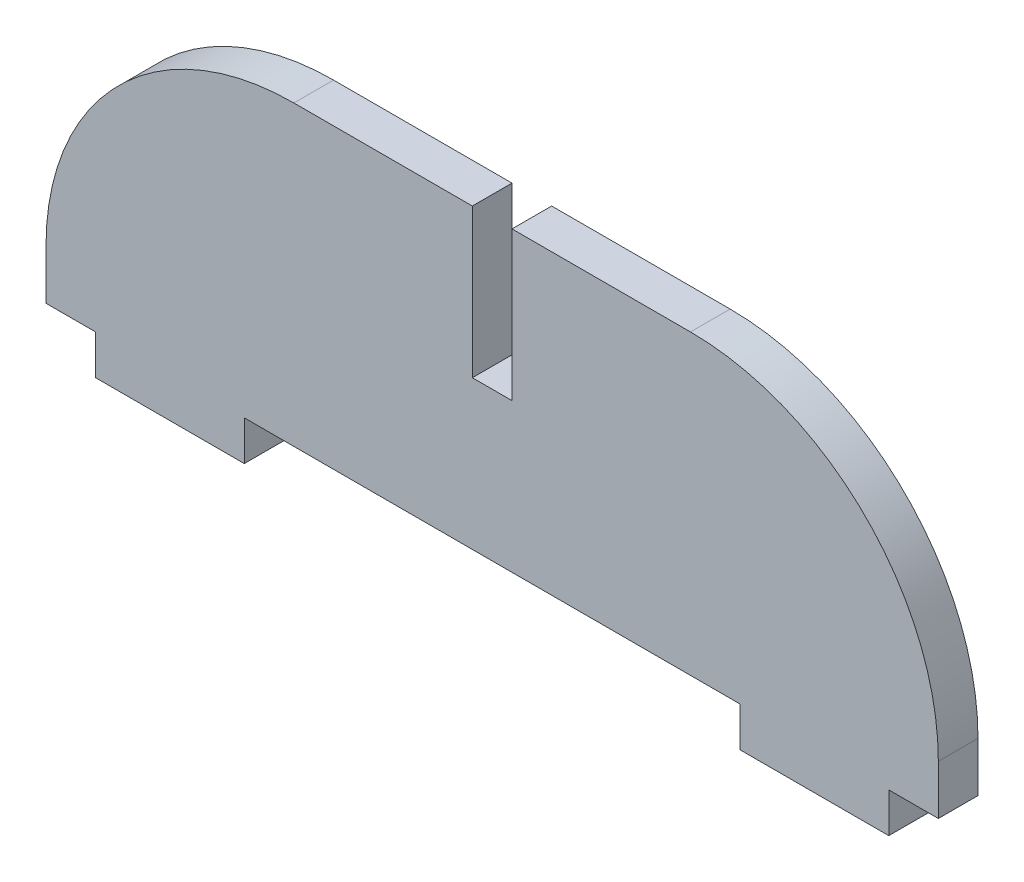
ISO-10303-21;
HEADER;
FILE_DESCRIPTION(('STEP AP214'),'2;1');
FILE_NAME('part.step','',(''),(''),'','','');
FILE_SCHEMA(('AUTOMOTIVE_DESIGN { 1 0 10303 214 1 1 1 1 }'));
ENDSEC;
DATA;
#1=APPLICATION_CONTEXT('core data for automotive mechanical design processes');
#2=APPLICATION_PROTOCOL_DEFINITION('international standard','automotive_design',2000,#1);
#3=PRODUCT_CONTEXT('',#1,'mechanical');
#4=PRODUCT('Part','Part','',(#3));
#5=PRODUCT_RELATED_PRODUCT_CATEGORY('part','',(#4));
#6=PRODUCT_DEFINITION_FORMATION('','',#4);
#7=PRODUCT_DEFINITION_CONTEXT('part definition',#1,'design');
#8=PRODUCT_DEFINITION('design','',#6,#7);
#9=PRODUCT_DEFINITION_SHAPE('','',#8);
#10=(LENGTH_UNIT() NAMED_UNIT(*) SI_UNIT(.MILLI.,.METRE.));
#11=(NAMED_UNIT(*) PLANE_ANGLE_UNIT() SI_UNIT($,.RADIAN.));
#12=(NAMED_UNIT(*) SI_UNIT($,.STERADIAN.) SOLID_ANGLE_UNIT());
#13=UNCERTAINTY_MEASURE_WITH_UNIT(LENGTH_MEASURE(1.E-05),#10,'distance_accuracy_value','');
#14=(GEOMETRIC_REPRESENTATION_CONTEXT(3) GLOBAL_UNCERTAINTY_ASSIGNED_CONTEXT((#13)) GLOBAL_UNIT_ASSIGNED_CONTEXT((#10,
#11,#12)) REPRESENTATION_CONTEXT('',''));
#15=CARTESIAN_POINT('',(0.,0.,0.));
#16=DIRECTION('',(0.,0.,1.));
#17=DIRECTION('',(1.,0.,0.));
#18=AXIS2_PLACEMENT_3D('',#15,#16,#17);
#19=CARTESIAN_POINT('',(-45.,0.,2.));
#20=DIRECTION('',(1.,0.,0.));
#21=DIRECTION('',(0.,0.,-1.));
#22=AXIS2_PLACEMENT_3D('',#19,#20,#21);
#23=PLANE('',#22);
#24=DIRECTION('',(0.,-1.,0.));
#25=VECTOR('',#24,1.);
#26=CARTESIAN_POINT('',(-45.,0.,-2.));
#27=LINE('',#26,#25);
#28=CARTESIAN_POINT('',(-45.,5.,-2.));
#29=VERTEX_POINT('',#28);
#30=CARTESIAN_POINT('',(-45.,0.,-2.));
#31=VERTEX_POINT('',#30);
#32=EDGE_CURVE('E188',#29,#31,#27,.T.);
#33=ORIENTED_EDGE('',*,*,#32,.T.);
#34=DIRECTION('',(0.,0.,-1.));
#35=VECTOR('',#34,1.);
#36=CARTESIAN_POINT('',(-45.,0.,2.));
#37=LINE('',#36,#35);
#38=CARTESIAN_POINT('',(-45.,0.,2.));
#39=VERTEX_POINT('',#38);
#40=EDGE_CURVE('E11',#39,#31,#37,.T.);
#41=ORIENTED_EDGE('',*,*,#40,.F.);
#42=DIRECTION('',(0.,-1.,0.));
#43=VECTOR('',#42,1.);
#44=CARTESIAN_POINT('',(-45.,0.,2.));
#45=LINE('',#44,#43);
#46=CARTESIAN_POINT('',(-45.,5.,2.));
#47=VERTEX_POINT('',#46);
#48=EDGE_CURVE('E222',#47,#39,#45,.T.);
#49=ORIENTED_EDGE('',*,*,#48,.F.);
#50=DIRECTION('',(0.,0.,-1.));
#51=VECTOR('',#50,1.);
#52=CARTESIAN_POINT('',(-45.,5.,2.));
#53=LINE('',#52,#51);
#54=EDGE_CURVE('E184',#47,#29,#53,.T.);
#55=ORIENTED_EDGE('',*,*,#54,.T.);
#56=EDGE_LOOP('',(#33,#41,#49,#55));
#57=FACE_BOUND('',#56,.T.);
#58=ADVANCED_FACE('F32',(#57),#23,.F.);
#59=CARTESIAN_POINT('',(-45.,0.,2.));
#60=DIRECTION('',(0.,1.,0.));
#61=DIRECTION('',(0.,0.,1.));
#62=AXIS2_PLACEMENT_3D('',#59,#60,#61);
#63=PLANE('',#62);
#64=DIRECTION('',(1.,0.,0.));
#65=VECTOR('',#64,1.);
#66=CARTESIAN_POINT('',(-45.,0.,-2.));
#67=LINE('',#66,#65);
#68=CARTESIAN_POINT('',(-40.,0.,-2.));
#69=VERTEX_POINT('',#68);
#70=EDGE_CURVE('E191',#31,#69,#67,.T.);
#71=ORIENTED_EDGE('',*,*,#70,.T.);
#72=DIRECTION('',(0.,0.,-1.));
#73=VECTOR('',#72,1.);
#74=CARTESIAN_POINT('',(-40.,0.,2.));
#75=LINE('',#74,#73);
#76=CARTESIAN_POINT('',(-40.,0.,2.));
#77=VERTEX_POINT('',#76);
#78=EDGE_CURVE('E40',#77,#69,#75,.T.);
#79=ORIENTED_EDGE('',*,*,#78,.F.);
#80=DIRECTION('',(1.,0.,0.));
#81=VECTOR('',#80,1.);
#82=CARTESIAN_POINT('',(-45.,0.,2.));
#83=LINE('',#82,#81);
#84=EDGE_CURVE('E121',#39,#77,#83,.T.);
#85=ORIENTED_EDGE('',*,*,#84,.F.);
#86=ORIENTED_EDGE('',*,*,#40,.T.);
#87=EDGE_LOOP('',(#71,#79,#85,#86));
#88=FACE_BOUND('',#87,.T.);
#89=ADVANCED_FACE('F330',(#88),#63,.F.);
#90=CARTESIAN_POINT('',(-40.,0.,2.));
#91=DIRECTION('',(1.,0.,0.));
#92=DIRECTION('',(0.,0.,-1.));
#93=AXIS2_PLACEMENT_3D('',#90,#91,#92);
#94=PLANE('',#93);
#95=DIRECTION('',(0.,-1.,0.));
#96=VECTOR('',#95,1.);
#97=CARTESIAN_POINT('',(-40.,0.,-2.));
#98=LINE('',#97,#96);
#99=CARTESIAN_POINT('',(-40.,-4.,-2.));
#100=VERTEX_POINT('',#99);
#101=EDGE_CURVE('E193',#69,#100,#98,.T.);
#102=ORIENTED_EDGE('',*,*,#101,.T.);
#103=DIRECTION('',(0.,0.,-1.));
#104=VECTOR('',#103,1.);
#105=CARTESIAN_POINT('',(-40.,-4.,2.));
#106=LINE('',#105,#104);
#107=CARTESIAN_POINT('',(-40.,-4.,2.));
#108=VERTEX_POINT('',#107);
#109=EDGE_CURVE('E259',#108,#100,#106,.T.);
#110=ORIENTED_EDGE('',*,*,#109,.F.);
#111=DIRECTION('',(0.,-1.,0.));
#112=VECTOR('',#111,1.);
#113=CARTESIAN_POINT('',(-40.,0.,2.));
#114=LINE('',#113,#112);
#115=EDGE_CURVE('E267',#77,#108,#114,.T.);
#116=ORIENTED_EDGE('',*,*,#115,.F.);
#117=ORIENTED_EDGE('',*,*,#78,.T.);
#118=EDGE_LOOP('',(#102,#110,#116,#117));
#119=FACE_BOUND('',#118,.T.);
#120=ADVANCED_FACE('F265',(#119),#94,.F.);
#121=CARTESIAN_POINT('',(-40.,-4.,2.));
#122=DIRECTION('',(0.,1.,0.));
#123=DIRECTION('',(0.,0.,1.));
#124=AXIS2_PLACEMENT_3D('',#121,#122,#123);
#125=PLANE('',#124);
#126=DIRECTION('',(1.,0.,0.));
#127=VECTOR('',#126,1.);
#128=CARTESIAN_POINT('',(-40.,-4.,-2.));
#129=LINE('',#128,#127);
#130=CARTESIAN_POINT('',(-25.,-4.,-2.));
#131=VERTEX_POINT('',#130);
#132=EDGE_CURVE('E195',#100,#131,#129,.T.);
#133=ORIENTED_EDGE('',*,*,#132,.T.);
#134=DIRECTION('',(0.,0.,-1.));
#135=VECTOR('',#134,1.);
#136=CARTESIAN_POINT('',(-25.,-4.,2.));
#137=LINE('',#136,#135);
#138=CARTESIAN_POINT('',(-25.,-4.,2.));
#139=VERTEX_POINT('',#138);
#140=EDGE_CURVE('E256',#139,#131,#137,.T.);
#141=ORIENTED_EDGE('',*,*,#140,.F.);
#142=DIRECTION('',(1.,0.,0.));
#143=VECTOR('',#142,1.);
#144=CARTESIAN_POINT('',(-40.,-4.,2.));
#145=LINE('',#144,#143);
#146=EDGE_CURVE('E285',#108,#139,#145,.T.);
#147=ORIENTED_EDGE('',*,*,#146,.F.);
#148=ORIENTED_EDGE('',*,*,#109,.T.);
#149=EDGE_LOOP('',(#133,#141,#147,#148));
#150=FACE_BOUND('',#149,.T.);
#151=ADVANCED_FACE('F276',(#150),#125,.F.);
#152=CARTESIAN_POINT('',(-25.,0.,2.));
#153=DIRECTION('',(-1.,0.,0.));
#154=DIRECTION('',(0.,0.,1.));
#155=AXIS2_PLACEMENT_3D('',#152,#153,#154);
#156=PLANE('',#155);
#157=DIRECTION('',(0.,1.,0.));
#158=VECTOR('',#157,1.);
#159=CARTESIAN_POINT('',(-25.,0.,-2.));
#160=LINE('',#159,#158);
#161=CARTESIAN_POINT('',(-25.,0.,-2.));
#162=VERTEX_POINT('',#161);
#163=EDGE_CURVE('E197',#131,#162,#160,.T.);
#164=ORIENTED_EDGE('',*,*,#163,.T.);
#165=DIRECTION('',(0.,0.,-1.));
#166=VECTOR('',#165,1.);
#167=CARTESIAN_POINT('',(-25.,0.,2.));
#168=LINE('',#167,#166);
#169=CARTESIAN_POINT('',(-25.,0.,2.));
#170=VERTEX_POINT('',#169);
#171=EDGE_CURVE('E253',#170,#162,#168,.T.);
#172=ORIENTED_EDGE('',*,*,#171,.F.);
#173=DIRECTION('',(0.,1.,0.));
#174=VECTOR('',#173,1.);
#175=CARTESIAN_POINT('',(-25.,0.,2.));
#176=LINE('',#175,#174);
#177=EDGE_CURVE('E282',#139,#170,#176,.T.);
#178=ORIENTED_EDGE('',*,*,#177,.F.);
#179=ORIENTED_EDGE('',*,*,#140,.T.);
#180=EDGE_LOOP('',(#164,#172,#178,#179));
#181=FACE_BOUND('',#180,.T.);
#182=ADVANCED_FACE('F280',(#181),#156,.F.);
#183=CARTESIAN_POINT('',(-25.,0.,2.));
#184=DIRECTION('',(0.,1.,0.));
#185=DIRECTION('',(0.,0.,1.));
#186=AXIS2_PLACEMENT_3D('',#183,#184,#185);
#187=PLANE('',#186);
#188=DIRECTION('',(1.,0.,0.));
#189=VECTOR('',#188,1.);
#190=CARTESIAN_POINT('',(-25.,0.,-2.));
#191=LINE('',#190,#189);
#192=CARTESIAN_POINT('',(25.,0.,-2.));
#193=VERTEX_POINT('',#192);
#194=EDGE_CURVE('E199',#162,#193,#191,.T.);
#195=ORIENTED_EDGE('',*,*,#194,.T.);
#196=DIRECTION('',(0.,0.,-1.));
#197=VECTOR('',#196,1.);
#198=CARTESIAN_POINT('',(25.,0.,2.));
#199=LINE('',#198,#197);
#200=CARTESIAN_POINT('',(25.,0.,2.));
#201=VERTEX_POINT('',#200);
#202=EDGE_CURVE('E250',#201,#193,#199,.T.);
#203=ORIENTED_EDGE('',*,*,#202,.F.);
#204=DIRECTION('',(1.,0.,0.));
#205=VECTOR('',#204,1.);
#206=CARTESIAN_POINT('',(-25.,0.,2.));
#207=LINE('',#206,#205);
#208=EDGE_CURVE('E284',#170,#201,#207,.T.);
#209=ORIENTED_EDGE('',*,*,#208,.F.);
#210=ORIENTED_EDGE('',*,*,#171,.T.);
#211=EDGE_LOOP('',(#195,#203,#209,#210));
#212=FACE_BOUND('',#211,.T.);
#213=ADVANCED_FACE('F343',(#212),#187,.F.);
#214=CARTESIAN_POINT('',(25.,0.,2.));
#215=DIRECTION('',(1.,0.,0.));
#216=DIRECTION('',(0.,0.,-1.));
#217=AXIS2_PLACEMENT_3D('',#214,#215,#216);
#218=PLANE('',#217);
#219=DIRECTION('',(0.,-1.,0.));
#220=VECTOR('',#219,1.);
#221=CARTESIAN_POINT('',(25.,0.,-2.));
#222=LINE('',#221,#220);
#223=CARTESIAN_POINT('',(25.,-4.,-2.));
#224=VERTEX_POINT('',#223);
#225=EDGE_CURVE('E201',#193,#224,#222,.T.);
#226=ORIENTED_EDGE('',*,*,#225,.T.);
#227=DIRECTION('',(0.,0.,-1.));
#228=VECTOR('',#227,1.);
#229=CARTESIAN_POINT('',(25.,-4.,2.));
#230=LINE('',#229,#228);
#231=CARTESIAN_POINT('',(25.,-4.,2.));
#232=VERTEX_POINT('',#231);
#233=EDGE_CURVE('E247',#232,#224,#230,.T.);
#234=ORIENTED_EDGE('',*,*,#233,.F.);
#235=DIRECTION('',(0.,-1.,0.));
#236=VECTOR('',#235,1.);
#237=CARTESIAN_POINT('',(25.,0.,2.));
#238=LINE('',#237,#236);
#239=EDGE_CURVE('E287',#201,#232,#238,.T.);
#240=ORIENTED_EDGE('',*,*,#239,.F.);
#241=ORIENTED_EDGE('',*,*,#202,.T.);
#242=EDGE_LOOP('',(#226,#234,#240,#241));
#243=FACE_BOUND('',#242,.T.);
#244=ADVANCED_FACE('F346',(#243),#218,.F.);
#245=CARTESIAN_POINT('',(25.,-4.,2.));
#246=DIRECTION('',(0.,1.,0.));
#247=DIRECTION('',(0.,0.,1.));
#248=AXIS2_PLACEMENT_3D('',#245,#246,#247);
#249=PLANE('',#248);
#250=DIRECTION('',(1.,0.,0.));
#251=VECTOR('',#250,1.);
#252=CARTESIAN_POINT('',(25.,-4.,-2.));
#253=LINE('',#252,#251);
#254=CARTESIAN_POINT('',(40.,-4.,-2.));
#255=VERTEX_POINT('',#254);
#256=EDGE_CURVE('E203',#224,#255,#253,.T.);
#257=ORIENTED_EDGE('',*,*,#256,.T.);
#258=DIRECTION('',(0.,0.,-1.));
#259=VECTOR('',#258,1.);
#260=CARTESIAN_POINT('',(40.,-4.,2.));
#261=LINE('',#260,#259);
#262=CARTESIAN_POINT('',(40.,-4.,2.));
#263=VERTEX_POINT('',#262);
#264=EDGE_CURVE('E244',#263,#255,#261,.T.);
#265=ORIENTED_EDGE('',*,*,#264,.F.);
#266=DIRECTION('',(1.,0.,0.));
#267=VECTOR('',#266,1.);
#268=CARTESIAN_POINT('',(25.,-4.,2.));
#269=LINE('',#268,#267);
#270=EDGE_CURVE('E293',#232,#263,#269,.T.);
#271=ORIENTED_EDGE('',*,*,#270,.F.);
#272=ORIENTED_EDGE('',*,*,#233,.T.);
#273=EDGE_LOOP('',(#257,#265,#271,#272));
#274=FACE_BOUND('',#273,.T.);
#275=ADVANCED_FACE('F350',(#274),#249,.F.);
#276=CARTESIAN_POINT('',(40.,0.,2.));
#277=DIRECTION('',(-1.,0.,0.));
#278=DIRECTION('',(0.,0.,1.));
#279=AXIS2_PLACEMENT_3D('',#276,#277,#278);
#280=PLANE('',#279);
#281=DIRECTION('',(0.,1.,0.));
#282=VECTOR('',#281,1.);
#283=CARTESIAN_POINT('',(40.,0.,-2.));
#284=LINE('',#283,#282);
#285=CARTESIAN_POINT('',(40.,0.,-2.));
#286=VERTEX_POINT('',#285);
#287=EDGE_CURVE('E205',#255,#286,#284,.T.);
#288=ORIENTED_EDGE('',*,*,#287,.T.);
#289=DIRECTION('',(0.,0.,-1.));
#290=VECTOR('',#289,1.);
#291=CARTESIAN_POINT('',(40.,0.,2.));
#292=LINE('',#291,#290);
#293=CARTESIAN_POINT('',(40.,0.,2.));
#294=VERTEX_POINT('',#293);
#295=EDGE_CURVE('E241',#294,#286,#292,.T.);
#296=ORIENTED_EDGE('',*,*,#295,.F.);
#297=DIRECTION('',(0.,1.,0.));
#298=VECTOR('',#297,1.);
#299=CARTESIAN_POINT('',(40.,0.,2.));
#300=LINE('',#299,#298);
#301=EDGE_CURVE('E295',#263,#294,#300,.T.);
#302=ORIENTED_EDGE('',*,*,#301,.F.);
#303=ORIENTED_EDGE('',*,*,#264,.T.);
#304=EDGE_LOOP('',(#288,#296,#302,#303));
#305=FACE_BOUND('',#304,.T.);
#306=ADVANCED_FACE('F354',(#305),#280,.F.);
#307=CARTESIAN_POINT('',(40.,0.,2.));
#308=DIRECTION('',(0.,1.,0.));
#309=DIRECTION('',(0.,0.,1.));
#310=AXIS2_PLACEMENT_3D('',#307,#308,#309);
#311=PLANE('',#310);
#312=DIRECTION('',(1.,0.,0.));
#313=VECTOR('',#312,1.);
#314=CARTESIAN_POINT('',(40.,0.,-2.));
#315=LINE('',#314,#313);
#316=CARTESIAN_POINT('',(45.,0.,-2.));
#317=VERTEX_POINT('',#316);
#318=EDGE_CURVE('E207',#286,#317,#315,.T.);
#319=ORIENTED_EDGE('',*,*,#318,.T.);
#320=DIRECTION('',(0.,0.,-1.));
#321=VECTOR('',#320,1.);
#322=CARTESIAN_POINT('',(45.,0.,2.));
#323=LINE('',#322,#321);
#324=CARTESIAN_POINT('',(45.,0.,2.));
#325=VERTEX_POINT('',#324);
#326=EDGE_CURVE('E238',#325,#317,#323,.T.);
#327=ORIENTED_EDGE('',*,*,#326,.F.);
#328=DIRECTION('',(1.,0.,0.));
#329=VECTOR('',#328,1.);
#330=CARTESIAN_POINT('',(40.,0.,2.));
#331=LINE('',#330,#329);
#332=EDGE_CURVE('E297',#294,#325,#331,.T.);
#333=ORIENTED_EDGE('',*,*,#332,.F.);
#334=ORIENTED_EDGE('',*,*,#295,.T.);
#335=EDGE_LOOP('',(#319,#327,#333,#334));
#336=FACE_BOUND('',#335,.T.);
#337=ADVANCED_FACE('F358',(#336),#311,.F.);
#338=CARTESIAN_POINT('',(45.,0.,2.));
#339=DIRECTION('',(-1.,0.,0.));
#340=DIRECTION('',(0.,0.,1.));
#341=AXIS2_PLACEMENT_3D('',#338,#339,#340);
#342=PLANE('',#341);
#343=DIRECTION('',(0.,1.,0.));
#344=VECTOR('',#343,1.);
#345=CARTESIAN_POINT('',(45.,0.,-2.));
#346=LINE('',#345,#344);
#347=CARTESIAN_POINT('',(45.,5.,-2.));
#348=VERTEX_POINT('',#347);
#349=EDGE_CURVE('E209',#317,#348,#346,.T.);
#350=ORIENTED_EDGE('',*,*,#349,.T.);
#351=DIRECTION('',(0.,0.,-1.));
#352=VECTOR('',#351,1.);
#353=CARTESIAN_POINT('',(45.,5.,2.));
#354=LINE('',#353,#352);
#355=CARTESIAN_POINT('',(45.,5.,2.));
#356=VERTEX_POINT('',#355);
#357=EDGE_CURVE('E235',#356,#348,#354,.T.);
#358=ORIENTED_EDGE('',*,*,#357,.F.);
#359=DIRECTION('',(0.,1.,0.));
#360=VECTOR('',#359,1.);
#361=CARTESIAN_POINT('',(45.,0.,2.));
#362=LINE('',#361,#360);
#363=EDGE_CURVE('E299',#325,#356,#362,.T.);
#364=ORIENTED_EDGE('',*,*,#363,.F.);
#365=ORIENTED_EDGE('',*,*,#326,.T.);
#366=EDGE_LOOP('',(#350,#358,#364,#365));
#367=FACE_BOUND('',#366,.T.);
#368=ADVANCED_FACE('F362',(#367),#342,.F.);
#369=CARTESIAN_POINT('',(20.,5.,2.));
#370=DIRECTION('',(0.,0.,-1.));
#371=DIRECTION('',(-1.,0.,0.));
#372=AXIS2_PLACEMENT_3D('',#369,#370,#371);
#373=CYLINDRICAL_SURFACE('',#372,25.);
#374=CARTESIAN_POINT('',(20.,5.,-2.));
#375=DIRECTION('',(0.,0.,1.));
#376=DIRECTION('',(-1.,0.,0.));
#377=AXIS2_PLACEMENT_3D('',#374,#375,#376);
#378=CIRCLE('',#377,25.);
#379=CARTESIAN_POINT('',(20.,30.,-2.));
#380=VERTEX_POINT('',#379);
#381=EDGE_CURVE('E211',#348,#380,#378,.T.);
#382=ORIENTED_EDGE('',*,*,#381,.T.);
#383=DIRECTION('',(0.,0.,-1.));
#384=VECTOR('',#383,1.);
#385=CARTESIAN_POINT('',(20.,30.,2.));
#386=LINE('',#385,#384);
#387=CARTESIAN_POINT('',(20.,30.,2.));
#388=VERTEX_POINT('',#387);
#389=EDGE_CURVE('E232',#388,#380,#386,.T.);
#390=ORIENTED_EDGE('',*,*,#389,.F.);
#391=CARTESIAN_POINT('',(20.,5.,2.));
#392=DIRECTION('',(0.,0.,1.));
#393=DIRECTION('',(-1.,0.,0.));
#394=AXIS2_PLACEMENT_3D('',#391,#392,#393);
#395=CIRCLE('',#394,25.);
#396=EDGE_CURVE('E301',#356,#388,#395,.T.);
#397=ORIENTED_EDGE('',*,*,#396,.F.);
#398=ORIENTED_EDGE('',*,*,#357,.T.);
#399=EDGE_LOOP('',(#382,#390,#397,#398));
#400=FACE_BOUND('',#399,.T.);
#401=ADVANCED_FACE('F366',(#400),#373,.T.);
#402=CARTESIAN_POINT('',(2.,30.,2.));
#403=DIRECTION('',(0.,-1.,0.));
#404=DIRECTION('',(0.,0.,-1.));
#405=AXIS2_PLACEMENT_3D('',#402,#403,#404);
#406=PLANE('',#405);
#407=DIRECTION('',(-1.,0.,0.));
#408=VECTOR('',#407,1.);
#409=CARTESIAN_POINT('',(2.,30.,-2.));
#410=LINE('',#409,#408);
#411=CARTESIAN_POINT('',(2.,30.,-2.));
#412=VERTEX_POINT('',#411);
#413=EDGE_CURVE('E213',#380,#412,#410,.T.);
#414=ORIENTED_EDGE('',*,*,#413,.T.);
#415=DIRECTION('',(0.,0.,-1.));
#416=VECTOR('',#415,1.);
#417=CARTESIAN_POINT('',(2.,30.,2.));
#418=LINE('',#417,#416);
#419=CARTESIAN_POINT('',(2.,30.,2.));
#420=VERTEX_POINT('',#419);
#421=EDGE_CURVE('E229',#420,#412,#418,.T.);
#422=ORIENTED_EDGE('',*,*,#421,.F.);
#423=DIRECTION('',(-1.,0.,0.));
#424=VECTOR('',#423,1.);
#425=CARTESIAN_POINT('',(2.,30.,2.));
#426=LINE('',#425,#424);
#427=EDGE_CURVE('E303',#388,#420,#426,.T.);
#428=ORIENTED_EDGE('',*,*,#427,.F.);
#429=ORIENTED_EDGE('',*,*,#389,.T.);
#430=EDGE_LOOP('',(#414,#422,#428,#429));
#431=FACE_BOUND('',#430,.T.);
#432=ADVANCED_FACE('F370',(#431),#406,.F.);
#433=CARTESIAN_POINT('',(2.,30.,2.));
#434=DIRECTION('',(1.,0.,0.));
#435=DIRECTION('',(0.,1.,0.));
#436=AXIS2_PLACEMENT_3D('',#433,#434,#435);
#437=PLANE('',#436);
#438=DIRECTION('',(0.,-1.,0.));
#439=VECTOR('',#438,1.);
#440=CARTESIAN_POINT('',(2.,30.,-2.));
#441=LINE('',#440,#439);
#442=CARTESIAN_POINT('',(2.,15.,-2.));
#443=VERTEX_POINT('',#442);
#444=EDGE_CURVE('E215',#412,#443,#441,.T.);
#445=ORIENTED_EDGE('',*,*,#444,.T.);
#446=DIRECTION('',(0.,0.,-1.));
#447=VECTOR('',#446,1.);
#448=CARTESIAN_POINT('',(2.,15.,2.));
#449=LINE('',#448,#447);
#450=CARTESIAN_POINT('',(2.,15.,2.));
#451=VERTEX_POINT('',#450);
#452=EDGE_CURVE('E226',#451,#443,#449,.T.);
#453=ORIENTED_EDGE('',*,*,#452,.F.);
#454=DIRECTION('',(0.,-1.,0.));
#455=VECTOR('',#454,1.);
#456=CARTESIAN_POINT('',(2.,30.,2.));
#457=LINE('',#456,#455);
#458=EDGE_CURVE('E305',#420,#451,#457,.T.);
#459=ORIENTED_EDGE('',*,*,#458,.F.);
#460=ORIENTED_EDGE('',*,*,#421,.T.);
#461=EDGE_LOOP('',(#445,#453,#459,#460));
#462=FACE_BOUND('',#461,.T.);
#463=ADVANCED_FACE('F311',(#462),#437,.F.);
#464=CARTESIAN_POINT('',(-2.,15.,2.));
#465=DIRECTION('',(0.,-1.,0.));
#466=DIRECTION('',(0.,0.,-1.));
#467=AXIS2_PLACEMENT_3D('',#464,#465,#466);
#468=PLANE('',#467);
#469=DIRECTION('',(-1.,0.,0.));
#470=VECTOR('',#469,1.);
#471=CARTESIAN_POINT('',(-2.,15.,-2.));
#472=LINE('',#471,#470);
#473=CARTESIAN_POINT('',(-2.,15.,-2.));
#474=VERTEX_POINT('',#473);
#475=EDGE_CURVE('E217',#443,#474,#472,.T.);
#476=ORIENTED_EDGE('',*,*,#475,.T.);
#477=DIRECTION('',(0.,0.,-1.));
#478=VECTOR('',#477,1.);
#479=CARTESIAN_POINT('',(-2.,15.,2.));
#480=LINE('',#479,#478);
#481=CARTESIAN_POINT('',(-2.,15.,2.));
#482=VERTEX_POINT('',#481);
#483=EDGE_CURVE('E179',#482,#474,#480,.T.);
#484=ORIENTED_EDGE('',*,*,#483,.F.);
#485=DIRECTION('',(-1.,0.,0.));
#486=VECTOR('',#485,1.);
#487=CARTESIAN_POINT('',(-2.,15.,2.));
#488=LINE('',#487,#486);
#489=EDGE_CURVE('E170',#451,#482,#488,.T.);
#490=ORIENTED_EDGE('',*,*,#489,.F.);
#491=ORIENTED_EDGE('',*,*,#452,.T.);
#492=EDGE_LOOP('',(#476,#484,#490,#491));
#493=FACE_BOUND('',#492,.T.);
#494=ADVANCED_FACE('F315',(#493),#468,.F.);
#495=CARTESIAN_POINT('',(-2.,30.,2.));
#496=DIRECTION('',(-1.,0.,0.));
#497=DIRECTION('',(0.,-1.,0.));
#498=AXIS2_PLACEMENT_3D('',#495,#496,#497);
#499=PLANE('',#498);
#500=DIRECTION('',(0.,1.,0.));
#501=VECTOR('',#500,1.);
#502=CARTESIAN_POINT('',(-2.,30.,-2.));
#503=LINE('',#502,#501);
#504=CARTESIAN_POINT('',(-2.,30.,-2.));
#505=VERTEX_POINT('',#504);
#506=EDGE_CURVE('E178',#474,#505,#503,.T.);
#507=ORIENTED_EDGE('',*,*,#506,.T.);
#508=DIRECTION('',(0.,0.,-1.));
#509=VECTOR('',#508,1.);
#510=CARTESIAN_POINT('',(-2.,30.,2.));
#511=LINE('',#510,#509);
#512=CARTESIAN_POINT('',(-2.,30.,2.));
#513=VERTEX_POINT('',#512);
#514=EDGE_CURVE('E175',#513,#505,#511,.T.);
#515=ORIENTED_EDGE('',*,*,#514,.F.);
#516=DIRECTION('',(0.,1.,0.));
#517=VECTOR('',#516,1.);
#518=CARTESIAN_POINT('',(-2.,30.,2.));
#519=LINE('',#518,#517);
#520=EDGE_CURVE('E164',#482,#513,#519,.T.);
#521=ORIENTED_EDGE('',*,*,#520,.F.);
#522=ORIENTED_EDGE('',*,*,#483,.T.);
#523=EDGE_LOOP('',(#507,#515,#521,#522));
#524=FACE_BOUND('',#523,.T.);
#525=ADVANCED_FACE('F176',(#524),#499,.F.);
#526=CARTESIAN_POINT('',(-20.,30.,2.));
#527=DIRECTION('',(0.,-1.,0.));
#528=DIRECTION('',(0.,0.,-1.));
#529=AXIS2_PLACEMENT_3D('',#526,#527,#528);
#530=PLANE('',#529);
#531=DIRECTION('',(-1.,0.,0.));
#532=VECTOR('',#531,1.);
#533=CARTESIAN_POINT('',(-20.,30.,-2.));
#534=LINE('',#533,#532);
#535=CARTESIAN_POINT('',(-20.,30.,-2.));
#536=VERTEX_POINT('',#535);
#537=EDGE_CURVE('E107',#505,#536,#534,.T.);
#538=ORIENTED_EDGE('',*,*,#537,.T.);
#539=DIRECTION('',(0.,0.,-1.));
#540=VECTOR('',#539,1.);
#541=CARTESIAN_POINT('',(-20.,30.,2.));
#542=LINE('',#541,#540);
#543=CARTESIAN_POINT('',(-20.,30.,2.));
#544=VERTEX_POINT('',#543);
#545=EDGE_CURVE('E180',#544,#536,#542,.T.);
#546=ORIENTED_EDGE('',*,*,#545,.F.);
#547=DIRECTION('',(-1.,0.,0.));
#548=VECTOR('',#547,1.);
#549=CARTESIAN_POINT('',(-20.,30.,2.));
#550=LINE('',#549,#548);
#551=EDGE_CURVE('E168',#513,#544,#550,.T.);
#552=ORIENTED_EDGE('',*,*,#551,.F.);
#553=ORIENTED_EDGE('',*,*,#514,.T.);
#554=EDGE_LOOP('',(#538,#546,#552,#553));
#555=FACE_BOUND('',#554,.T.);
#556=ADVANCED_FACE('F182',(#555),#530,.F.);
#557=CARTESIAN_POINT('',(-20.,5.,2.));
#558=DIRECTION('',(0.,0.,-1.));
#559=DIRECTION('',(-1.,0.,0.));
#560=AXIS2_PLACEMENT_3D('',#557,#558,#559);
#561=CYLINDRICAL_SURFACE('',#560,25.);
#562=CARTESIAN_POINT('',(-20.,5.,-2.));
#563=DIRECTION('',(0.,0.,1.));
#564=DIRECTION('',(-1.,0.,0.));
#565=AXIS2_PLACEMENT_3D('',#562,#563,#564);
#566=CIRCLE('',#565,25.);
#567=EDGE_CURVE('E113',#536,#29,#566,.T.);
#568=ORIENTED_EDGE('',*,*,#567,.T.);
#569=ORIENTED_EDGE('',*,*,#54,.F.);
#570=CARTESIAN_POINT('',(-20.,5.,2.));
#571=DIRECTION('',(0.,0.,1.));
#572=DIRECTION('',(-1.,0.,0.));
#573=AXIS2_PLACEMENT_3D('',#570,#571,#572);
#574=CIRCLE('',#573,25.);
#575=EDGE_CURVE('E48',#544,#47,#574,.T.);
#576=ORIENTED_EDGE('',*,*,#575,.F.);
#577=ORIENTED_EDGE('',*,*,#545,.T.);
#578=EDGE_LOOP('',(#568,#569,#576,#577));
#579=FACE_BOUND('',#578,.T.);
#580=ADVANCED_FACE('F319',(#579),#561,.T.);
#581=CARTESIAN_POINT('',(-20.,5.,2.));
#582=DIRECTION('',(0.,0.,-1.));
#583=DIRECTION('',(-1.,0.,0.));
#584=AXIS2_PLACEMENT_3D('',#581,#582,#583);
#585=PLANE('',#584);
#586=ORIENTED_EDGE('',*,*,#48,.T.);
#587=ORIENTED_EDGE('',*,*,#84,.T.);
#588=ORIENTED_EDGE('',*,*,#115,.T.);
#589=ORIENTED_EDGE('',*,*,#146,.T.);
#590=ORIENTED_EDGE('',*,*,#177,.T.);
#591=ORIENTED_EDGE('',*,*,#208,.T.);
#592=ORIENTED_EDGE('',*,*,#239,.T.);
#593=ORIENTED_EDGE('',*,*,#270,.T.);
#594=ORIENTED_EDGE('',*,*,#301,.T.);
#595=ORIENTED_EDGE('',*,*,#332,.T.);
#596=ORIENTED_EDGE('',*,*,#363,.T.);
#597=ORIENTED_EDGE('',*,*,#396,.T.);
#598=ORIENTED_EDGE('',*,*,#427,.T.);
#599=ORIENTED_EDGE('',*,*,#458,.T.);
#600=ORIENTED_EDGE('',*,*,#489,.T.);
#601=ORIENTED_EDGE('',*,*,#520,.T.);
#602=ORIENTED_EDGE('',*,*,#551,.T.);
#603=ORIENTED_EDGE('',*,*,#575,.T.);
#604=EDGE_LOOP('',(#586,#587,#588,#589,#590,#591,#592,#593,#594,#595,#596,#597,#598,#599,#600,
#601,#602,#603));
#605=FACE_BOUND('',#604,.T.);
#606=ADVANCED_FACE('F166',(#605),#585,.F.);
#607=CARTESIAN_POINT('',(-20.,5.,-2.));
#608=DIRECTION('',(0.,0.,-1.));
#609=DIRECTION('',(-1.,0.,0.));
#610=AXIS2_PLACEMENT_3D('',#607,#608,#609);
#611=PLANE('',#610);
#612=ORIENTED_EDGE('',*,*,#32,.F.);
#613=ORIENTED_EDGE('',*,*,#567,.F.);
#614=ORIENTED_EDGE('',*,*,#537,.F.);
#615=ORIENTED_EDGE('',*,*,#506,.F.);
#616=ORIENTED_EDGE('',*,*,#475,.F.);
#617=ORIENTED_EDGE('',*,*,#444,.F.);
#618=ORIENTED_EDGE('',*,*,#413,.F.);
#619=ORIENTED_EDGE('',*,*,#381,.F.);
#620=ORIENTED_EDGE('',*,*,#349,.F.);
#621=ORIENTED_EDGE('',*,*,#318,.F.);
#622=ORIENTED_EDGE('',*,*,#287,.F.);
#623=ORIENTED_EDGE('',*,*,#256,.F.);
#624=ORIENTED_EDGE('',*,*,#225,.F.);
#625=ORIENTED_EDGE('',*,*,#194,.F.);
#626=ORIENTED_EDGE('',*,*,#163,.F.);
#627=ORIENTED_EDGE('',*,*,#132,.F.);
#628=ORIENTED_EDGE('',*,*,#101,.F.);
#629=ORIENTED_EDGE('',*,*,#70,.F.);
#630=EDGE_LOOP('',(#612,#613,#614,#615,#616,#617,#618,#619,#620,#621,#622,#623,#624,#625,#626,
#627,#628,#629));
#631=FACE_BOUND('',#630,.T.);
#632=ADVANCED_FACE('F271',(#631),#611,.T.);
#633=CLOSED_SHELL('',(#58,#89,#120,#151,#182,#213,#244,#275,#306,#337,#368,#401,#432,#463,#494,
#525,#556,#580,#606,#632));
#634=MANIFOLD_SOLID_BREP('B2',#633);
#635=ADVANCED_BREP_SHAPE_REPRESENTATION('',(#18,#634),#14);
#636=SHAPE_DEFINITION_REPRESENTATION(#9,#635);
ENDSEC;
END-ISO-10303-21;
